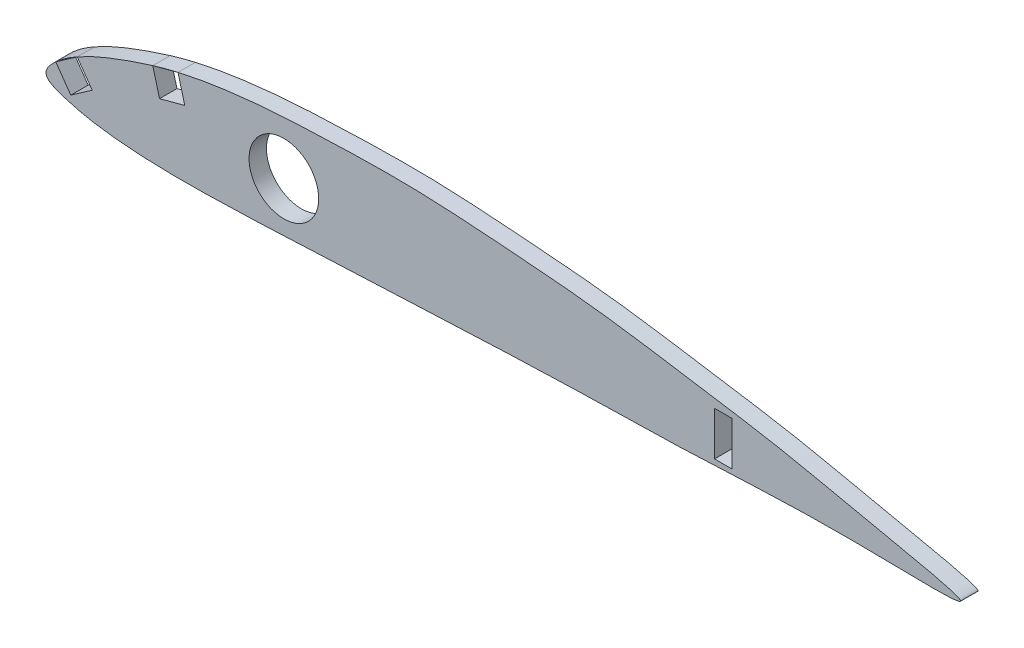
ISO-10303-21;
HEADER;
FILE_DESCRIPTION(('STEP AP214'),'2;1');
FILE_NAME('part.step','',(''),(''),'','','');
FILE_SCHEMA(('AUTOMOTIVE_DESIGN { 1 0 10303 214 1 1 1 1 }'));
ENDSEC;
DATA;
#1=APPLICATION_CONTEXT('core data for automotive mechanical design processes');
#2=APPLICATION_PROTOCOL_DEFINITION('international standard','automotive_design',2000,#1);
#3=PRODUCT_CONTEXT('',#1,'mechanical');
#4=PRODUCT('Part','Part','',(#3));
#5=PRODUCT_RELATED_PRODUCT_CATEGORY('part','',(#4));
#6=PRODUCT_DEFINITION_FORMATION('','',#4);
#7=PRODUCT_DEFINITION_CONTEXT('part definition',#1,'design');
#8=PRODUCT_DEFINITION('design','',#6,#7);
#9=PRODUCT_DEFINITION_SHAPE('','',#8);
#10=(LENGTH_UNIT() NAMED_UNIT(*) SI_UNIT(.MILLI.,.METRE.));
#11=(NAMED_UNIT(*) PLANE_ANGLE_UNIT() SI_UNIT($,.RADIAN.));
#12=(NAMED_UNIT(*) SI_UNIT($,.STERADIAN.) SOLID_ANGLE_UNIT());
#13=UNCERTAINTY_MEASURE_WITH_UNIT(LENGTH_MEASURE(1.E-05),#10,'distance_accuracy_value','');
#14=(GEOMETRIC_REPRESENTATION_CONTEXT(3) GLOBAL_UNCERTAINTY_ASSIGNED_CONTEXT((#13)) GLOBAL_UNIT_ASSIGNED_CONTEXT((#10,
#11,#12)) REPRESENTATION_CONTEXT('',''));
#15=CARTESIAN_POINT('',(0.,0.,0.));
#16=DIRECTION('',(0.,0.,1.));
#17=DIRECTION('',(1.,0.,0.));
#18=AXIS2_PLACEMENT_3D('',#15,#16,#17);
#19=CARTESIAN_POINT('',(0.,0.,0.));
#20=DIRECTION('',(0.,0.,-1.));
#21=DIRECTION('',(-1.,0.,0.));
#22=AXIS2_PLACEMENT_3D('',#19,#20,#21);
#23=PLANE('',#22);
#24=DIRECTION('',(0.,-1.,0.));
#25=VECTOR('',#24,1.);
#26=CARTESIAN_POINT('',(125.047,0.,0.));
#27=LINE('',#26,#25);
#28=CARTESIAN_POINT('',(125.047,8.,0.));
#29=VERTEX_POINT('',#28);
#30=CARTESIAN_POINT('',(125.047,0.,0.));
#31=VERTEX_POINT('',#30);
#32=EDGE_CURVE('E196',#29,#31,#27,.T.);
#33=ORIENTED_EDGE('',*,*,#32,.F.);
#34=DIRECTION('',(1.,0.,0.));
#35=VECTOR('',#34,1.);
#36=CARTESIAN_POINT('',(0.,8.,0.));
#37=LINE('',#36,#35);
#38=CARTESIAN_POINT('',(121.872,8.,0.));
#39=VERTEX_POINT('',#38);
#40=EDGE_CURVE('E144',#39,#29,#37,.T.);
#41=ORIENTED_EDGE('',*,*,#40,.F.);
#42=DIRECTION('',(0.,1.,0.));
#43=VECTOR('',#42,1.);
#44=CARTESIAN_POINT('',(121.872,0.,0.));
#45=LINE('',#44,#43);
#46=CARTESIAN_POINT('',(121.872,0.,0.));
#47=VERTEX_POINT('',#46);
#48=EDGE_CURVE('E132',#47,#39,#45,.T.);
#49=ORIENTED_EDGE('',*,*,#48,.F.);
#50=DIRECTION('',(-1.,0.,0.));
#51=VECTOR('',#50,1.);
#52=CARTESIAN_POINT('',(0.,1.4818536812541E-12,0.));
#53=LINE('',#52,#51);
#54=EDGE_CURVE('E152',#31,#47,#53,.T.);
#55=ORIENTED_EDGE('',*,*,#54,.F.);
#56=EDGE_LOOP('',(#33,#41,#49,#55));
#57=FACE_BOUND('',#56,.T.);
#58=DIRECTION('',(0.573576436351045,-0.819152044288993,0.));
#59=VECTOR('',#58,1.);
#60=CARTESIAN_POINT('',(6.34720029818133,4.44435749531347,0.));
#61=LINE('',#60,#59);
#62=CARTESIAN_POINT('',(5.68764872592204,5.38629475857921,0.));
#63=VERTEX_POINT('',#62);
#64=CARTESIAN_POINT('',(8.41930650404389,1.48508314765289,0.));
#65=VERTEX_POINT('',#64);
#66=EDGE_CURVE('E201',#63,#65,#61,.T.);
#67=ORIENTED_EDGE('',*,*,#66,.F.);
#68=CARTESIAN_POINT('',(0.,0.,0.));
#69=CARTESIAN_POINT('',(-0.0459347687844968,0.892029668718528,0.));
#70=CARTESIAN_POINT('',(1.90191177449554,2.89446911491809,0.));
#71=CARTESIAN_POINT('',(4.6684552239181,4.87588891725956,0.));
#72=CARTESIAN_POINT('',(8.2541015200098,6.80672662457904,0.));
#73=CARTESIAN_POINT('',(15.1207457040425,9.59988217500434,0.));
#74=CARTESIAN_POINT('',(23.4503914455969,12.2574932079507,0.));
#75=CARTESIAN_POINT('',(33.3103354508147,13.8342724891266,0.));
#76=CARTESIAN_POINT('',(41.6672100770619,14.6682605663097,0.));
#77=CARTESIAN_POINT('',(52.7910280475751,15.1344604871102,0.));
#78=CARTESIAN_POINT('',(66.7097954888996,15.5292364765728,0.));
#79=CARTESIAN_POINT('',(83.368588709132,14.3600514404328,0.));
#80=CARTESIAN_POINT('',(100.147657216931,13.0526280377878,0.));
#81=CARTESIAN_POINT('',(116.545994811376,10.4257396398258,0.));
#82=CARTESIAN_POINT('',(134.136976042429,7.73650957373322,0.));
#83=CARTESIAN_POINT('',(147.56176668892,4.57825905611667,0.));
#84=CARTESIAN_POINT('',(176.13881574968,-1.08233623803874,0.));
#85=CARTESIAN_POINT('',(139.163038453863,0.220038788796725,0.));
#86=CARTESIAN_POINT('',(123.083147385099,-1.25152694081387,0.));
#87=CARTESIAN_POINT('',(88.3709977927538,-1.79872524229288,0.));
#88=CARTESIAN_POINT('',(61.2366274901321,-3.27724658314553,0.));
#89=CARTESIAN_POINT('',(33.2993817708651,-4.49500477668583,0.));
#90=CARTESIAN_POINT('',(19.5697181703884,-4.72013261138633,0.));
#91=CARTESIAN_POINT('',(9.46401932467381,-3.74136507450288,0.));
#92=CARTESIAN_POINT('',(4.31935957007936,-2.56504228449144,0.));
#93=CARTESIAN_POINT('',(0.063034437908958,-1.22409647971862,0.));
#94=CARTESIAN_POINT('',(0.,0.,0.));
#95=B_SPLINE_CURVE_WITH_KNOTS('',3,(#68,#69,#70,#71,#72,#73,#74,#75,#76,#77,#78,#79,#80,#81,#82,
#83,#84,#85,#86,#87,#88,#89,#90,#91,#92,#93,#94),.UNSPECIFIED.,.T.,.F.,(4,1,1,1,1,1,1,1,1,1,1,1,
1,1,1,1,1,1,1,1,1,1,1,1,4),(0.,0.0105604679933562,0.0182111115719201,0.0322098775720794,
0.0455249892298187,0.0840694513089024,0.10897429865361,0.133649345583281,0.158232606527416,
0.207343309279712,0.25652270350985,0.30582635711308,0.355445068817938,0.40521420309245,
0.4553904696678,0.506006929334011,0.555121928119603,0.653369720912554,0.702490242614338,
0.849938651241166,0.899083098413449,0.948194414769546,0.972905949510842,0.985508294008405,1.),.UNSPECIFIED.);
#96=CARTESIAN_POINT('',(19.465770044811,10.8900291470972,0.));
#97=VERTEX_POINT('',#96);
#98=EDGE_CURVE('E171',#63,#97,#95,.T.);
#99=ORIENTED_EDGE('',*,*,#98,.T.);
#100=DIRECTION('',(-0.258819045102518,0.965925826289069,0.));
#101=VECTOR('',#100,1.);
#102=CARTESIAN_POINT('',(20.884317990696,5.59593614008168,0.));
#103=LINE('',#102,#101);
#104=CARTESIAN_POINT('',(20.6983957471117,6.28980739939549,0.));
#105=VERTEX_POINT('',#104);
#106=EDGE_CURVE('E210',#105,#97,#103,.T.);
#107=ORIENTED_EDGE('',*,*,#106,.F.);
#108=DIRECTION('',(-0.965925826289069,-0.258819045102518,0.));
#109=VECTOR('',#108,1.);
#110=CARTESIAN_POINT('',(-0.185922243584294,0.693871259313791,0.));
#111=LINE('',#110,#109);
#112=CARTESIAN_POINT('',(25.2986174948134,7.52243310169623,0.));
#113=VERTEX_POINT('',#112);
#114=EDGE_CURVE('E220',#113,#105,#111,.T.);
#115=ORIENTED_EDGE('',*,*,#114,.F.);
#116=DIRECTION('',(0.258819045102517,-0.965925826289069,0.));
#117=VECTOR('',#116,1.);
#118=CARTESIAN_POINT('',(25.4845397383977,6.82856184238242,0.));
#119=LINE('',#118,#117);
#120=CARTESIAN_POINT('',(24.0659917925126,12.1226548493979,0.));
#121=VERTEX_POINT('',#120);
#122=EDGE_CURVE('E230',#121,#113,#119,.T.);
#123=ORIENTED_EDGE('',*,*,#122,.F.);
#124=CARTESIAN_POINT('',(1.78643711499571,2.65463698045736,0.));
#125=VERTEX_POINT('',#124);
#126=EDGE_CURVE('E164',#121,#125,#95,.T.);
#127=ORIENTED_EDGE('',*,*,#126,.T.);
#128=DIRECTION('',(-0.573576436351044,0.819152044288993,0.));
#129=VECTOR('',#128,1.);
#130=CARTESIAN_POINT('',(2.445988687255,1.71269971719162,0.));
#131=LINE('',#130,#129);
#132=CARTESIAN_POINT('',(4.51809489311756,-1.24657463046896,0.));
#133=VERTEX_POINT('',#132);
#134=EDGE_CURVE('E158',#133,#125,#131,.T.);
#135=ORIENTED_EDGE('',*,*,#134,.F.);
#136=DIRECTION('',(-0.819152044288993,-0.573576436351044,0.));
#137=VECTOR('',#136,1.);
#138=CARTESIAN_POINT('',(2.07210620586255,-2.95927434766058,0.));
#139=LINE('',#138,#137);
#140=EDGE_CURVE('E162',#65,#133,#139,.T.);
#141=ORIENTED_EDGE('',*,*,#140,.F.);
#142=EDGE_LOOP('',(#67,#99,#107,#115,#123,#127,#135,#141));
#143=FACE_BOUND('',#142,.T.);
#144=CARTESIAN_POINT('',(43.365,4.99999999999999,0.));
#145=DIRECTION('',(0.,0.,-1.));
#146=DIRECTION('',(-1.,0.,0.));
#147=AXIS2_PLACEMENT_3D('',#144,#145,#146);
#148=CIRCLE('',#147,6.35);
#149=CARTESIAN_POINT('',(37.015,4.99999999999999,0.));
#150=VERTEX_POINT('',#149);
#151=EDGE_CURVE('E204',#150,#150,#148,.T.);
#152=ORIENTED_EDGE('',*,*,#151,.F.);
#153=EDGE_LOOP('',(#152));
#154=FACE_BOUND('',#153,.T.);
#155=ADVANCED_FACE('F45',(#57,#143,#154),#23,.T.);
#156=CARTESIAN_POINT('',(0.,0.,3.175));
#157=DIRECTION('',(0.,0.,-1.));
#158=DIRECTION('',(-1.,0.,0.));
#159=AXIS2_PLACEMENT_3D('',#156,#157,#158);
#160=PLANE('',#159);
#161=DIRECTION('',(-1.,0.,0.));
#162=VECTOR('',#161,1.);
#163=CARTESIAN_POINT('',(125.047,8.,3.175));
#164=LINE('',#163,#162);
#165=CARTESIAN_POINT('',(125.047,8.,3.175));
#166=VERTEX_POINT('',#165);
#167=CARTESIAN_POINT('',(121.872,8.,3.175));
#168=VERTEX_POINT('',#167);
#169=EDGE_CURVE('E13',#166,#168,#164,.T.);
#170=ORIENTED_EDGE('',*,*,#169,.F.);
#171=DIRECTION('',(0.,1.,0.));
#172=VECTOR('',#171,1.);
#173=CARTESIAN_POINT('',(125.047,0.,3.175));
#174=LINE('',#173,#172);
#175=CARTESIAN_POINT('',(125.047,0.,3.175));
#176=VERTEX_POINT('',#175);
#177=EDGE_CURVE('E150',#176,#166,#174,.T.);
#178=ORIENTED_EDGE('',*,*,#177,.F.);
#179=DIRECTION('',(1.,0.,0.));
#180=VECTOR('',#179,1.);
#181=CARTESIAN_POINT('',(125.047,0.,3.175));
#182=LINE('',#181,#180);
#183=CARTESIAN_POINT('',(121.872,0.,3.175));
#184=VERTEX_POINT('',#183);
#185=EDGE_CURVE('E143',#184,#176,#182,.T.);
#186=ORIENTED_EDGE('',*,*,#185,.F.);
#187=DIRECTION('',(0.,-1.,0.));
#188=VECTOR('',#187,1.);
#189=CARTESIAN_POINT('',(121.872,0.,3.175));
#190=LINE('',#189,#188);
#191=EDGE_CURVE('E129',#168,#184,#190,.T.);
#192=ORIENTED_EDGE('',*,*,#191,.F.);
#193=EDGE_LOOP('',(#170,#178,#186,#192));
#194=FACE_BOUND('',#193,.T.);
#195=CARTESIAN_POINT('',(43.365,4.99999999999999,3.175));
#196=DIRECTION('',(0.,0.,1.));
#197=DIRECTION('',(1.,0.,0.));
#198=AXIS2_PLACEMENT_3D('',#195,#196,#197);
#199=CIRCLE('',#198,6.35);
#200=CARTESIAN_POINT('',(49.715,4.99999999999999,3.175));
#201=VERTEX_POINT('',#200);
#202=EDGE_CURVE('E206',#201,#201,#199,.T.);
#203=ORIENTED_EDGE('',*,*,#202,.F.);
#204=EDGE_LOOP('',(#203));
#205=FACE_BOUND('',#204,.T.);
#206=CARTESIAN_POINT('',(0.,0.,3.175));
#207=CARTESIAN_POINT('',(-0.0459347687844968,0.892029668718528,3.175));
#208=CARTESIAN_POINT('',(1.90191177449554,2.89446911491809,3.175));
#209=CARTESIAN_POINT('',(4.6684552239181,4.87588891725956,3.175));
#210=CARTESIAN_POINT('',(8.2541015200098,6.80672662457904,3.175));
#211=CARTESIAN_POINT('',(15.1207457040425,9.59988217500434,3.175));
#212=CARTESIAN_POINT('',(23.4503914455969,12.2574932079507,3.175));
#213=CARTESIAN_POINT('',(33.3103354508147,13.8342724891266,3.175));
#214=CARTESIAN_POINT('',(41.6672100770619,14.6682605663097,3.175));
#215=CARTESIAN_POINT('',(52.7910280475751,15.1344604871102,3.175));
#216=CARTESIAN_POINT('',(66.7097954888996,15.5292364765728,3.175));
#217=CARTESIAN_POINT('',(83.368588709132,14.3600514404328,3.175));
#218=CARTESIAN_POINT('',(100.147657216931,13.0526280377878,3.175));
#219=CARTESIAN_POINT('',(116.545994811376,10.4257396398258,3.175));
#220=CARTESIAN_POINT('',(134.136976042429,7.73650957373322,3.175));
#221=CARTESIAN_POINT('',(147.56176668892,4.57825905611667,3.175));
#222=CARTESIAN_POINT('',(176.13881574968,-1.08233623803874,3.175));
#223=CARTESIAN_POINT('',(139.163038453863,0.220038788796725,3.175));
#224=CARTESIAN_POINT('',(123.083147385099,-1.25152694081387,3.175));
#225=CARTESIAN_POINT('',(88.3709977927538,-1.79872524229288,3.175));
#226=CARTESIAN_POINT('',(61.2366274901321,-3.27724658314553,3.175));
#227=CARTESIAN_POINT('',(33.2993817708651,-4.49500477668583,3.175));
#228=CARTESIAN_POINT('',(19.5697181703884,-4.72013261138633,3.175));
#229=CARTESIAN_POINT('',(9.46401932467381,-3.74136507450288,3.175));
#230=CARTESIAN_POINT('',(4.31935957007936,-2.56504228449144,3.175));
#231=CARTESIAN_POINT('',(0.063034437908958,-1.22409647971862,3.175));
#232=CARTESIAN_POINT('',(0.,0.,3.175));
#233=B_SPLINE_CURVE_WITH_KNOTS('',3,(#206,#207,#208,#209,#210,#211,#212,#213,#214,#215,#216,
#217,#218,#219,#220,#221,#222,#223,#224,#225,#226,#227,#228,#229,#230,#231,#232),.UNSPECIFIED.,
.T.,.F.,(4,1,1,1,1,1,1,1,1,1,1,1,1,1,1,1,1,1,1,1,1,1,1,1,4),(0.,0.0105604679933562,
0.0182111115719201,0.0322098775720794,0.0455249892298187,0.0840694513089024,0.10897429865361,
0.133649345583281,0.158232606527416,0.207343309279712,0.25652270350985,0.30582635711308,
0.355445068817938,0.40521420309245,0.4553904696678,0.506006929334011,0.555121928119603,
0.653369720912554,0.702490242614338,0.849938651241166,0.899083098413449,0.948194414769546,
0.972905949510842,0.985508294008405,1.),.UNSPECIFIED.);
#234=CARTESIAN_POINT('',(5.68764872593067,5.3862947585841,3.175));
#235=VERTEX_POINT('',#234);
#236=CARTESIAN_POINT('',(19.465770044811,10.8900291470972,3.175));
#237=VERTEX_POINT('',#236);
#238=EDGE_CURVE('E207',#235,#237,#233,.T.);
#239=ORIENTED_EDGE('',*,*,#238,.F.);
#240=DIRECTION('',(-0.573576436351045,0.819152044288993,0.));
#241=VECTOR('',#240,1.);
#242=CARTESIAN_POINT('',(5.68764872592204,5.38629475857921,3.175));
#243=LINE('',#242,#241);
#244=CARTESIAN_POINT('',(8.41930650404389,1.48508314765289,3.175));
#245=VERTEX_POINT('',#244);
#246=EDGE_CURVE('E163',#245,#235,#243,.T.);
#247=ORIENTED_EDGE('',*,*,#246,.F.);
#248=DIRECTION('',(0.819152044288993,0.573576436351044,0.));
#249=VECTOR('',#248,1.);
#250=CARTESIAN_POINT('',(8.41930650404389,1.48508314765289,3.175));
#251=LINE('',#250,#249);
#252=CARTESIAN_POINT('',(4.51809489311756,-1.24657463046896,3.175));
#253=VERTEX_POINT('',#252);
#254=EDGE_CURVE('E228',#253,#245,#251,.T.);
#255=ORIENTED_EDGE('',*,*,#254,.F.);
#256=DIRECTION('',(0.573576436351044,-0.819152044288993,0.));
#257=VECTOR('',#256,1.);
#258=CARTESIAN_POINT('',(1.78643711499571,2.65463698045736,3.175));
#259=LINE('',#258,#257);
#260=CARTESIAN_POINT('',(1.78643711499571,2.65463698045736,3.175));
#261=VERTEX_POINT('',#260);
#262=EDGE_CURVE('E157',#261,#253,#259,.T.);
#263=ORIENTED_EDGE('',*,*,#262,.F.);
#264=CARTESIAN_POINT('',(24.0659923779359,12.1226549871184,3.175));
#265=VERTEX_POINT('',#264);
#266=EDGE_CURVE('E213',#265,#261,#233,.T.);
#267=ORIENTED_EDGE('',*,*,#266,.F.);
#268=DIRECTION('',(-0.258819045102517,0.965925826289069,0.));
#269=VECTOR('',#268,1.);
#270=CARTESIAN_POINT('',(24.0659917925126,12.1226548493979,3.175));
#271=LINE('',#270,#269);
#272=CARTESIAN_POINT('',(25.2986174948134,7.52243310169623,3.175));
#273=VERTEX_POINT('',#272);
#274=EDGE_CURVE('E223',#273,#265,#271,.T.);
#275=ORIENTED_EDGE('',*,*,#274,.F.);
#276=DIRECTION('',(0.965925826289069,0.258819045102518,0.));
#277=VECTOR('',#276,1.);
#278=CARTESIAN_POINT('',(20.6983957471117,6.28980739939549,3.175));
#279=LINE('',#278,#277);
#280=CARTESIAN_POINT('',(20.6983957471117,6.28980739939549,3.175));
#281=VERTEX_POINT('',#280);
#282=EDGE_CURVE('E226',#281,#273,#279,.T.);
#283=ORIENTED_EDGE('',*,*,#282,.F.);
#284=DIRECTION('',(0.258819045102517,-0.965925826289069,0.));
#285=VECTOR('',#284,1.);
#286=CARTESIAN_POINT('',(19.465770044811,10.8900291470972,3.175));
#287=LINE('',#286,#285);
#288=EDGE_CURVE('E233',#237,#281,#287,.T.);
#289=ORIENTED_EDGE('',*,*,#288,.F.);
#290=EDGE_LOOP('',(#239,#247,#255,#263,#267,#275,#283,#289));
#291=FACE_BOUND('',#290,.T.);
#292=ADVANCED_FACE('F141',(#194,#205,#291),#160,.F.);
#293=DIRECTION('',(0.,0.,1.));
#294=VECTOR('',#293,1.);
#295=SURFACE_OF_LINEAR_EXTRUSION('',#95,#294);
#296=DIRECTION('',(0.,0.,1.));
#297=VECTOR('',#296,1.);
#298=CARTESIAN_POINT('',(1.78643711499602,2.65463698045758,0.));
#299=LINE('',#298,#297);
#300=EDGE_CURVE('E154',#125,#261,#299,.T.);
#301=ORIENTED_EDGE('',*,*,#300,.F.);
#302=ORIENTED_EDGE('',*,*,#126,.F.);
#303=DIRECTION('',(0.,0.,1.));
#304=VECTOR('',#303,1.);
#305=CARTESIAN_POINT('',(24.0659917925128,12.122654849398,0.));
#306=LINE('',#305,#304);
#307=EDGE_CURVE('E170',#121,#265,#306,.T.);
#308=ORIENTED_EDGE('',*,*,#307,.T.);
#309=ORIENTED_EDGE('',*,*,#266,.T.);
#310=EDGE_LOOP('',(#301,#302,#308,#309));
#311=FACE_BOUND('',#310,.T.);
#312=ADVANCED_FACE('F180',(#311),#295,.F.);
#313=DIRECTION('',(0.,0.,1.));
#314=VECTOR('',#313,1.);
#315=CARTESIAN_POINT('',(5.68764872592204,5.38629475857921,0.));
#316=LINE('',#315,#314);
#317=EDGE_CURVE('E159',#235,#63,#316,.F.);
#318=ORIENTED_EDGE('',*,*,#317,.F.);
#319=ORIENTED_EDGE('',*,*,#238,.T.);
#320=DIRECTION('',(0.,0.,1.));
#321=VECTOR('',#320,1.);
#322=CARTESIAN_POINT('',(19.4657700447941,10.8900291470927,0.));
#323=LINE('',#322,#321);
#324=EDGE_CURVE('E48',#97,#237,#323,.T.);
#325=ORIENTED_EDGE('',*,*,#324,.F.);
#326=ORIENTED_EDGE('',*,*,#98,.F.);
#327=EDGE_LOOP('',(#318,#319,#325,#326));
#328=FACE_BOUND('',#327,.T.);
#329=ADVANCED_FACE('F176',(#328),#295,.F.);
#330=CARTESIAN_POINT('',(43.365,4.99999999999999,-6.825));
#331=DIRECTION('',(0.,0.,1.));
#332=DIRECTION('',(1.,0.,0.));
#333=AXIS2_PLACEMENT_3D('',#330,#331,#332);
#334=CYLINDRICAL_SURFACE('',#333,6.35);
#335=ORIENTED_EDGE('',*,*,#151,.T.);
#336=EDGE_LOOP('',(#335));
#337=FACE_BOUND('',#336,.T.);
#338=ORIENTED_EDGE('',*,*,#202,.T.);
#339=EDGE_LOOP('',(#338));
#340=FACE_BOUND('',#339,.T.);
#341=ADVANCED_FACE('F179',(#337,#340),#334,.F.);
#342=CARTESIAN_POINT('',(19.465770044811,10.8900291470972,-6.825));
#343=DIRECTION('',(-0.965925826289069,-0.258819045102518,0.));
#344=DIRECTION('',(0.258819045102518,-0.965925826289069,0.));
#345=AXIS2_PLACEMENT_3D('',#342,#343,#344);
#346=PLANE('',#345);
#347=ORIENTED_EDGE('',*,*,#106,.T.);
#348=ORIENTED_EDGE('',*,*,#324,.T.);
#349=ORIENTED_EDGE('',*,*,#288,.T.);
#350=DIRECTION('',(0.,0.,1.));
#351=VECTOR('',#350,1.);
#352=CARTESIAN_POINT('',(20.6983957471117,6.28980739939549,-6.825));
#353=LINE('',#352,#351);
#354=EDGE_CURVE('E222',#105,#281,#353,.T.);
#355=ORIENTED_EDGE('',*,*,#354,.F.);
#356=EDGE_LOOP('',(#347,#348,#349,#355));
#357=FACE_BOUND('',#356,.T.);
#358=ADVANCED_FACE('F326',(#357),#346,.F.);
#359=CARTESIAN_POINT('',(24.0659917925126,12.1226548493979,-6.825));
#360=DIRECTION('',(0.965925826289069,0.258819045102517,0.));
#361=DIRECTION('',(-0.258819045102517,0.965925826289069,0.));
#362=AXIS2_PLACEMENT_3D('',#359,#360,#361);
#363=PLANE('',#362);
#364=ORIENTED_EDGE('',*,*,#122,.T.);
#365=DIRECTION('',(0.,0.,1.));
#366=VECTOR('',#365,1.);
#367=CARTESIAN_POINT('',(25.2986174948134,7.52243310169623,-6.825));
#368=LINE('',#367,#366);
#369=EDGE_CURVE('E232',#113,#273,#368,.T.);
#370=ORIENTED_EDGE('',*,*,#369,.T.);
#371=ORIENTED_EDGE('',*,*,#274,.T.);
#372=ORIENTED_EDGE('',*,*,#307,.F.);
#373=EDGE_LOOP('',(#364,#370,#371,#372));
#374=FACE_BOUND('',#373,.T.);
#375=ADVANCED_FACE('F316',(#374),#363,.F.);
#376=CARTESIAN_POINT('',(20.6983957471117,6.28980739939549,-6.825));
#377=DIRECTION('',(0.258819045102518,-0.965925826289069,0.));
#378=DIRECTION('',(0.965925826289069,0.258819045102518,0.));
#379=AXIS2_PLACEMENT_3D('',#376,#377,#378);
#380=PLANE('',#379);
#381=ORIENTED_EDGE('',*,*,#114,.T.);
#382=ORIENTED_EDGE('',*,*,#354,.T.);
#383=ORIENTED_EDGE('',*,*,#282,.T.);
#384=ORIENTED_EDGE('',*,*,#369,.F.);
#385=EDGE_LOOP('',(#381,#382,#383,#384));
#386=FACE_BOUND('',#385,.T.);
#387=ADVANCED_FACE('F306',(#386),#380,.F.);
#388=CARTESIAN_POINT('',(5.68764872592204,5.38629475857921,-6.825));
#389=DIRECTION('',(0.819152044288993,0.573576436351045,0.));
#390=DIRECTION('',(-0.573576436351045,0.819152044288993,0.));
#391=AXIS2_PLACEMENT_3D('',#388,#389,#390);
#392=PLANE('',#391);
#393=ORIENTED_EDGE('',*,*,#66,.T.);
#394=DIRECTION('',(0.,0.,1.));
#395=VECTOR('',#394,1.);
#396=CARTESIAN_POINT('',(8.41930650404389,1.48508314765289,-6.825));
#397=LINE('',#396,#395);
#398=EDGE_CURVE('E225',#65,#245,#397,.T.);
#399=ORIENTED_EDGE('',*,*,#398,.T.);
#400=ORIENTED_EDGE('',*,*,#246,.T.);
#401=ORIENTED_EDGE('',*,*,#317,.T.);
#402=EDGE_LOOP('',(#393,#399,#400,#401));
#403=FACE_BOUND('',#402,.T.);
#404=ADVANCED_FACE('F297',(#403),#392,.F.);
#405=CARTESIAN_POINT('',(8.41930650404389,1.48508314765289,-6.825));
#406=DIRECTION('',(0.573576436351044,-0.819152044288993,0.));
#407=DIRECTION('',(0.819152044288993,0.573576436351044,0.));
#408=AXIS2_PLACEMENT_3D('',#405,#406,#407);
#409=PLANE('',#408);
#410=ORIENTED_EDGE('',*,*,#140,.T.);
#411=DIRECTION('',(0.,0.,1.));
#412=VECTOR('',#411,1.);
#413=CARTESIAN_POINT('',(4.51809489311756,-1.24657463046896,-6.825));
#414=LINE('',#413,#412);
#415=EDGE_CURVE('E219',#133,#253,#414,.T.);
#416=ORIENTED_EDGE('',*,*,#415,.T.);
#417=ORIENTED_EDGE('',*,*,#254,.T.);
#418=ORIENTED_EDGE('',*,*,#398,.F.);
#419=EDGE_LOOP('',(#410,#416,#417,#418));
#420=FACE_BOUND('',#419,.T.);
#421=ADVANCED_FACE('F262',(#420),#409,.F.);
#422=CARTESIAN_POINT('',(1.78643711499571,2.65463698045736,-6.825));
#423=DIRECTION('',(-0.819152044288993,-0.573576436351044,0.));
#424=DIRECTION('',(0.573576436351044,-0.819152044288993,0.));
#425=AXIS2_PLACEMENT_3D('',#422,#423,#424);
#426=PLANE('',#425);
#427=ORIENTED_EDGE('',*,*,#134,.T.);
#428=ORIENTED_EDGE('',*,*,#300,.T.);
#429=ORIENTED_EDGE('',*,*,#262,.T.);
#430=ORIENTED_EDGE('',*,*,#415,.F.);
#431=EDGE_LOOP('',(#427,#428,#429,#430));
#432=FACE_BOUND('',#431,.T.);
#433=ADVANCED_FACE('F257',(#432),#426,.F.);
#434=CARTESIAN_POINT('',(125.047,0.,-6.825));
#435=DIRECTION('',(1.,0.,0.));
#436=DIRECTION('',(0.,0.,-1.));
#437=AXIS2_PLACEMENT_3D('',#434,#435,#436);
#438=PLANE('',#437);
#439=ORIENTED_EDGE('',*,*,#32,.T.);
#440=DIRECTION('',(0.,0.,1.));
#441=VECTOR('',#440,1.);
#442=CARTESIAN_POINT('',(125.047,0.,-6.825));
#443=LINE('',#442,#441);
#444=EDGE_CURVE('E153',#31,#176,#443,.T.);
#445=ORIENTED_EDGE('',*,*,#444,.T.);
#446=ORIENTED_EDGE('',*,*,#177,.T.);
#447=DIRECTION('',(0.,0.,1.));
#448=VECTOR('',#447,1.);
#449=CARTESIAN_POINT('',(125.047,8.,-6.825));
#450=LINE('',#449,#448);
#451=EDGE_CURVE('E54',#29,#166,#450,.T.);
#452=ORIENTED_EDGE('',*,*,#451,.F.);
#453=EDGE_LOOP('',(#439,#445,#446,#452));
#454=FACE_BOUND('',#453,.T.);
#455=ADVANCED_FACE('F251',(#454),#438,.F.);
#456=CARTESIAN_POINT('',(125.047,0.,-6.825));
#457=DIRECTION('',(0.,-1.,0.));
#458=DIRECTION('',(1.,0.,0.));
#459=AXIS2_PLACEMENT_3D('',#456,#457,#458);
#460=PLANE('',#459);
#461=ORIENTED_EDGE('',*,*,#54,.T.);
#462=DIRECTION('',(0.,0.,1.));
#463=VECTOR('',#462,1.);
#464=CARTESIAN_POINT('',(121.872,0.,-6.825));
#465=LINE('',#464,#463);
#466=EDGE_CURVE('E124',#47,#184,#465,.T.);
#467=ORIENTED_EDGE('',*,*,#466,.T.);
#468=ORIENTED_EDGE('',*,*,#185,.T.);
#469=ORIENTED_EDGE('',*,*,#444,.F.);
#470=EDGE_LOOP('',(#461,#467,#468,#469));
#471=FACE_BOUND('',#470,.T.);
#472=ADVANCED_FACE('F182',(#471),#460,.F.);
#473=CARTESIAN_POINT('',(121.872,0.,-6.825));
#474=DIRECTION('',(-1.,0.,0.));
#475=DIRECTION('',(0.,0.,1.));
#476=AXIS2_PLACEMENT_3D('',#473,#474,#475);
#477=PLANE('',#476);
#478=ORIENTED_EDGE('',*,*,#48,.T.);
#479=DIRECTION('',(0.,0.,1.));
#480=VECTOR('',#479,1.);
#481=CARTESIAN_POINT('',(121.872,8.,-6.825));
#482=LINE('',#481,#480);
#483=EDGE_CURVE('E62',#39,#168,#482,.T.);
#484=ORIENTED_EDGE('',*,*,#483,.T.);
#485=ORIENTED_EDGE('',*,*,#191,.T.);
#486=ORIENTED_EDGE('',*,*,#466,.F.);
#487=EDGE_LOOP('',(#478,#484,#485,#486));
#488=FACE_BOUND('',#487,.T.);
#489=ADVANCED_FACE('F127',(#488),#477,.F.);
#490=CARTESIAN_POINT('',(125.047,8.,-6.825));
#491=DIRECTION('',(0.,1.,0.));
#492=DIRECTION('',(0.,0.,1.));
#493=AXIS2_PLACEMENT_3D('',#490,#491,#492);
#494=PLANE('',#493);
#495=ORIENTED_EDGE('',*,*,#40,.T.);
#496=ORIENTED_EDGE('',*,*,#451,.T.);
#497=ORIENTED_EDGE('',*,*,#169,.T.);
#498=ORIENTED_EDGE('',*,*,#483,.F.);
#499=EDGE_LOOP('',(#495,#496,#497,#498));
#500=FACE_BOUND('',#499,.T.);
#501=ADVANCED_FACE('F137',(#500),#494,.F.);
#502=CLOSED_SHELL('',(#155,#292,#312,#329,#341,#358,#375,#387,#404,#421,#433,#455,#472,#489,#501));
#503=MANIFOLD_SOLID_BREP('B2',#502);
#504=CARTESIAN_POINT('',(0.,0.,0.));
#505=CARTESIAN_POINT('',(-0.0459347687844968,0.892029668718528,0.));
#506=CARTESIAN_POINT('',(1.90191177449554,2.89446911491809,0.));
#507=CARTESIAN_POINT('',(4.6684552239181,4.87588891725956,0.));
#508=CARTESIAN_POINT('',(8.2541015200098,6.80672662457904,0.));
#509=CARTESIAN_POINT('',(15.1207457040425,9.59988217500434,0.));
#510=CARTESIAN_POINT('',(23.4503914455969,12.2574932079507,0.));
#511=CARTESIAN_POINT('',(33.3103354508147,13.8342724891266,0.));
#512=CARTESIAN_POINT('',(41.6672100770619,14.6682605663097,0.));
#513=CARTESIAN_POINT('',(52.7910280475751,15.1344604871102,0.));
#514=CARTESIAN_POINT('',(66.7097954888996,15.5292364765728,0.));
#515=CARTESIAN_POINT('',(83.368588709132,14.3600514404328,0.));
#516=CARTESIAN_POINT('',(100.147657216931,13.0526280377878,0.));
#517=CARTESIAN_POINT('',(116.545994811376,10.4257396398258,0.));
#518=CARTESIAN_POINT('',(134.136976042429,7.73650957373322,0.));
#519=CARTESIAN_POINT('',(147.56176668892,4.57825905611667,0.));
#520=CARTESIAN_POINT('',(176.13881574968,-1.08233623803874,0.));
#521=CARTESIAN_POINT('',(139.163038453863,0.220038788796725,0.));
#522=CARTESIAN_POINT('',(123.083147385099,-1.25152694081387,0.));
#523=CARTESIAN_POINT('',(88.3709977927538,-1.79872524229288,0.));
#524=CARTESIAN_POINT('',(61.2366274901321,-3.27724658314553,0.));
#525=CARTESIAN_POINT('',(33.2993817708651,-4.49500477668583,0.));
#526=CARTESIAN_POINT('',(19.5697181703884,-4.72013261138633,0.));
#527=CARTESIAN_POINT('',(9.46401932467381,-3.74136507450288,0.));
#528=CARTESIAN_POINT('',(4.31935957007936,-2.56504228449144,0.));
#529=CARTESIAN_POINT('',(0.063034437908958,-1.22409647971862,0.));
#530=CARTESIAN_POINT('',(0.,0.,0.));
#531=B_SPLINE_CURVE_WITH_KNOTS('',3,(#504,#505,#506,#507,#508,#509,#510,#511,#512,#513,#514,
#515,#516,#517,#518,#519,#520,#521,#522,#523,#524,#525,#526,#527,#528,#529,#530),.UNSPECIFIED.,
.T.,.F.,(4,1,1,1,1,1,1,1,1,1,1,1,1,1,1,1,1,1,1,1,1,1,1,1,4),(0.,0.0105604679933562,
0.0182111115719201,0.0322098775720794,0.0455249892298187,0.0840694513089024,0.10897429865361,
0.133649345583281,0.158232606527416,0.207343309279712,0.25652270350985,0.30582635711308,
0.355445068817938,0.40521420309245,0.4553904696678,0.506006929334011,0.555121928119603,
0.653369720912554,0.702490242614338,0.849938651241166,0.899083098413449,0.948194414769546,
0.972905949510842,0.985508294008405,1.),.UNSPECIFIED.);
#532=DIRECTION('',(0.,0.,1.));
#533=VECTOR('',#532,1.);
#534=SURFACE_OF_LINEAR_EXTRUSION('',#531,#533);
#535=CARTESIAN_POINT('',(19.465770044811,10.8900291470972,0.));
#536=VERTEX_POINT('',#535);
#537=CARTESIAN_POINT('',(24.0659917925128,12.122654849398,0.));
#538=VERTEX_POINT('',#537);
#539=EDGE_CURVE('E449',#536,#538,#531,.T.);
#540=ORIENTED_EDGE('',*,*,#539,.F.);
#541=DIRECTION('',(0.,0.,1.));
#542=VECTOR('',#541,1.);
#543=CARTESIAN_POINT('',(19.4657700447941,10.8900291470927,0.));
#544=LINE('',#543,#542);
#545=CARTESIAN_POINT('',(19.465770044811,10.8900291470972,3.175));
#546=VERTEX_POINT('',#545);
#547=EDGE_CURVE('E436',#536,#546,#544,.T.);
#548=ORIENTED_EDGE('',*,*,#547,.T.);
#549=CARTESIAN_POINT('',(0.,0.,3.175));
#550=CARTESIAN_POINT('',(-0.0459347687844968,0.892029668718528,3.175));
#551=CARTESIAN_POINT('',(1.90191177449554,2.89446911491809,3.175));
#552=CARTESIAN_POINT('',(4.6684552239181,4.87588891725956,3.175));
#553=CARTESIAN_POINT('',(8.2541015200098,6.80672662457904,3.175));
#554=CARTESIAN_POINT('',(15.1207457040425,9.59988217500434,3.175));
#555=CARTESIAN_POINT('',(23.4503914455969,12.2574932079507,3.175));
#556=CARTESIAN_POINT('',(33.3103354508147,13.8342724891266,3.175));
#557=CARTESIAN_POINT('',(41.6672100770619,14.6682605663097,3.175));
#558=CARTESIAN_POINT('',(52.7910280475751,15.1344604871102,3.175));
#559=CARTESIAN_POINT('',(66.7097954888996,15.5292364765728,3.175));
#560=CARTESIAN_POINT('',(83.368588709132,14.3600514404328,3.175));
#561=CARTESIAN_POINT('',(100.147657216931,13.0526280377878,3.175));
#562=CARTESIAN_POINT('',(116.545994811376,10.4257396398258,3.175));
#563=CARTESIAN_POINT('',(134.136976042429,7.73650957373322,3.175));
#564=CARTESIAN_POINT('',(147.56176668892,4.57825905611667,3.175));
#565=CARTESIAN_POINT('',(176.13881574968,-1.08233623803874,3.175));
#566=CARTESIAN_POINT('',(139.163038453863,0.220038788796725,3.175));
#567=CARTESIAN_POINT('',(123.083147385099,-1.25152694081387,3.175));
#568=CARTESIAN_POINT('',(88.3709977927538,-1.79872524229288,3.175));
#569=CARTESIAN_POINT('',(61.2366274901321,-3.27724658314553,3.175));
#570=CARTESIAN_POINT('',(33.2993817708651,-4.49500477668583,3.175));
#571=CARTESIAN_POINT('',(19.5697181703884,-4.72013261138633,3.175));
#572=CARTESIAN_POINT('',(9.46401932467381,-3.74136507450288,3.175));
#573=CARTESIAN_POINT('',(4.31935957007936,-2.56504228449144,3.175));
#574=CARTESIAN_POINT('',(0.063034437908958,-1.22409647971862,3.175));
#575=CARTESIAN_POINT('',(0.,0.,3.175));
#576=B_SPLINE_CURVE_WITH_KNOTS('',3,(#549,#550,#551,#552,#553,#554,#555,#556,#557,#558,#559,
#560,#561,#562,#563,#564,#565,#566,#567,#568,#569,#570,#571,#572,#573,#574,#575),.UNSPECIFIED.,
.T.,.F.,(4,1,1,1,1,1,1,1,1,1,1,1,1,1,1,1,1,1,1,1,1,1,1,1,4),(0.,0.0105604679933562,
0.0182111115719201,0.0322098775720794,0.0455249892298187,0.0840694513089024,0.10897429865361,
0.133649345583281,0.158232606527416,0.207343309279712,0.25652270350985,0.30582635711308,
0.355445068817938,0.40521420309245,0.4553904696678,0.506006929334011,0.555121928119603,
0.653369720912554,0.702490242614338,0.849938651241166,0.899083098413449,0.948194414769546,
0.972905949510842,0.985508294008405,1.),.UNSPECIFIED.);
#577=CARTESIAN_POINT('',(24.0659917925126,12.1226548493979,3.175));
#578=VERTEX_POINT('',#577);
#579=EDGE_CURVE('E421',#546,#578,#576,.T.);
#580=ORIENTED_EDGE('',*,*,#579,.T.);
#581=DIRECTION('',(0.,0.,1.));
#582=VECTOR('',#581,1.);
#583=CARTESIAN_POINT('',(24.0659917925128,12.122654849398,0.));
#584=LINE('',#583,#582);
#585=EDGE_CURVE('E429',#538,#578,#584,.T.);
#586=ORIENTED_EDGE('',*,*,#585,.F.);
#587=EDGE_LOOP('',(#540,#548,#580,#586));
#588=FACE_BOUND('',#587,.T.);
#589=ADVANCED_FACE('F417',(#588),#534,.F.);
#590=CARTESIAN_POINT('',(0.,0.,3.175));
#591=DIRECTION('',(0.,0.,-1.));
#592=DIRECTION('',(-1.,0.,0.));
#593=AXIS2_PLACEMENT_3D('',#590,#591,#592);
#594=PLANE('',#593);
#595=ORIENTED_EDGE('',*,*,#579,.F.);
#596=DIRECTION('',(-0.965925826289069,-0.258819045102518,0.));
#597=VECTOR('',#596,1.);
#598=CARTESIAN_POINT('',(19.465770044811,10.8900291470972,3.175));
#599=LINE('',#598,#597);
#600=EDGE_CURVE('E43',#578,#546,#599,.T.);
#601=ORIENTED_EDGE('',*,*,#600,.F.);
#602=EDGE_LOOP('',(#595,#601));
#603=FACE_BOUND('',#602,.T.);
#604=ADVANCED_FACE('F464',(#603),#594,.F.);
#605=CARTESIAN_POINT('',(0.,0.,0.));
#606=DIRECTION('',(0.,0.,-1.));
#607=DIRECTION('',(-1.,0.,0.));
#608=AXIS2_PLACEMENT_3D('',#605,#606,#607);
#609=PLANE('',#608);
#610=DIRECTION('',(0.965925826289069,0.258819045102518,0.));
#611=VECTOR('',#610,1.);
#612=CARTESIAN_POINT('',(-1.41854794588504,5.29409300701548,0.));
#613=LINE('',#612,#611);
#614=EDGE_CURVE('E443',#536,#538,#613,.T.);
#615=ORIENTED_EDGE('',*,*,#614,.F.);
#616=ORIENTED_EDGE('',*,*,#539,.T.);
#617=EDGE_LOOP('',(#615,#616));
#618=FACE_BOUND('',#617,.T.);
#619=ADVANCED_FACE('F419',(#618),#609,.T.);
#620=CARTESIAN_POINT('',(19.465770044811,10.8900291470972,-6.825));
#621=DIRECTION('',(-0.258819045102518,0.965925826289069,0.));
#622=DIRECTION('',(-0.965925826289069,-0.258819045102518,0.));
#623=AXIS2_PLACEMENT_3D('',#620,#621,#622);
#624=PLANE('',#623);
#625=ORIENTED_EDGE('',*,*,#614,.T.);
#626=ORIENTED_EDGE('',*,*,#585,.T.);
#627=ORIENTED_EDGE('',*,*,#600,.T.);
#628=ORIENTED_EDGE('',*,*,#547,.F.);
#629=EDGE_LOOP('',(#625,#626,#627,#628));
#630=FACE_BOUND('',#629,.T.);
#631=ADVANCED_FACE('F445',(#630),#624,.F.);
#632=CLOSED_SHELL('',(#589,#604,#619,#631));
#633=MANIFOLD_SOLID_BREP('B7',#632);
#634=CARTESIAN_POINT('',(0.,0.,0.));
#635=CARTESIAN_POINT('',(-0.0459347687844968,0.892029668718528,0.));
#636=CARTESIAN_POINT('',(1.90191177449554,2.89446911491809,0.));
#637=CARTESIAN_POINT('',(4.6684552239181,4.87588891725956,0.));
#638=CARTESIAN_POINT('',(8.2541015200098,6.80672662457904,0.));
#639=CARTESIAN_POINT('',(15.1207457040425,9.59988217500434,0.));
#640=CARTESIAN_POINT('',(23.4503914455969,12.2574932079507,0.));
#641=CARTESIAN_POINT('',(33.3103354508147,13.8342724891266,0.));
#642=CARTESIAN_POINT('',(41.6672100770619,14.6682605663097,0.));
#643=CARTESIAN_POINT('',(52.7910280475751,15.1344604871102,0.));
#644=CARTESIAN_POINT('',(66.7097954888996,15.5292364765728,0.));
#645=CARTESIAN_POINT('',(83.368588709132,14.3600514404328,0.));
#646=CARTESIAN_POINT('',(100.147657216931,13.0526280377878,0.));
#647=CARTESIAN_POINT('',(116.545994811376,10.4257396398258,0.));
#648=CARTESIAN_POINT('',(134.136976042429,7.73650957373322,0.));
#649=CARTESIAN_POINT('',(147.56176668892,4.57825905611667,0.));
#650=CARTESIAN_POINT('',(176.13881574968,-1.08233623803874,0.));
#651=CARTESIAN_POINT('',(139.163038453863,0.220038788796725,0.));
#652=CARTESIAN_POINT('',(123.083147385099,-1.25152694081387,0.));
#653=CARTESIAN_POINT('',(88.3709977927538,-1.79872524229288,0.));
#654=CARTESIAN_POINT('',(61.2366274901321,-3.27724658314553,0.));
#655=CARTESIAN_POINT('',(33.2993817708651,-4.49500477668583,0.));
#656=CARTESIAN_POINT('',(19.5697181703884,-4.72013261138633,0.));
#657=CARTESIAN_POINT('',(9.46401932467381,-3.74136507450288,0.));
#658=CARTESIAN_POINT('',(4.31935957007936,-2.56504228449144,0.));
#659=CARTESIAN_POINT('',(0.063034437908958,-1.22409647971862,0.));
#660=CARTESIAN_POINT('',(0.,0.,0.));
#661=B_SPLINE_CURVE_WITH_KNOTS('',3,(#634,#635,#636,#637,#638,#639,#640,#641,#642,#643,#644,
#645,#646,#647,#648,#649,#650,#651,#652,#653,#654,#655,#656,#657,#658,#659,#660),.UNSPECIFIED.,
.T.,.F.,(4,1,1,1,1,1,1,1,1,1,1,1,1,1,1,1,1,1,1,1,1,1,1,1,4),(0.,0.0105604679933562,
0.0182111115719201,0.0322098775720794,0.0455249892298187,0.0840694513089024,0.10897429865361,
0.133649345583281,0.158232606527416,0.207343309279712,0.25652270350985,0.30582635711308,
0.355445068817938,0.40521420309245,0.4553904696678,0.506006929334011,0.555121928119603,
0.653369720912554,0.702490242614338,0.849938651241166,0.899083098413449,0.948194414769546,
0.972905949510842,0.985508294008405,1.),.UNSPECIFIED.);
#662=DIRECTION('',(0.,0.,1.));
#663=VECTOR('',#662,1.);
#664=SURFACE_OF_LINEAR_EXTRUSION('',#661,#663);
#665=CARTESIAN_POINT('',(1.78643711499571,2.65463698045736,0.));
#666=VERTEX_POINT('',#665);
#667=CARTESIAN_POINT('',(5.68764872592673,5.38629475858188,0.));
#668=VERTEX_POINT('',#667);
#669=EDGE_CURVE('E532',#666,#668,#661,.T.);
#670=ORIENTED_EDGE('',*,*,#669,.F.);
#671=DIRECTION('',(0.,0.,1.));
#672=VECTOR('',#671,1.);
#673=CARTESIAN_POINT('',(1.78643711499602,2.65463698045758,0.));
#674=LINE('',#673,#672);
#675=CARTESIAN_POINT('',(1.78643711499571,2.65463698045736,3.175));
#676=VERTEX_POINT('',#675);
#677=EDGE_CURVE('E415',#666,#676,#674,.T.);
#678=ORIENTED_EDGE('',*,*,#677,.T.);
#679=CARTESIAN_POINT('',(0.,0.,3.175));
#680=CARTESIAN_POINT('',(-0.0459347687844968,0.892029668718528,3.175));
#681=CARTESIAN_POINT('',(1.90191177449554,2.89446911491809,3.175));
#682=CARTESIAN_POINT('',(4.6684552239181,4.87588891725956,3.175));
#683=CARTESIAN_POINT('',(8.2541015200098,6.80672662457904,3.175));
#684=CARTESIAN_POINT('',(15.1207457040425,9.59988217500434,3.175));
#685=CARTESIAN_POINT('',(23.4503914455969,12.2574932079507,3.175));
#686=CARTESIAN_POINT('',(33.3103354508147,13.8342724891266,3.175));
#687=CARTESIAN_POINT('',(41.6672100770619,14.6682605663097,3.175));
#688=CARTESIAN_POINT('',(52.7910280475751,15.1344604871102,3.175));
#689=CARTESIAN_POINT('',(66.7097954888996,15.5292364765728,3.175));
#690=CARTESIAN_POINT('',(83.368588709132,14.3600514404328,3.175));
#691=CARTESIAN_POINT('',(100.147657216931,13.0526280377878,3.175));
#692=CARTESIAN_POINT('',(116.545994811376,10.4257396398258,3.175));
#693=CARTESIAN_POINT('',(134.136976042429,7.73650957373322,3.175));
#694=CARTESIAN_POINT('',(147.56176668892,4.57825905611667,3.175));
#695=CARTESIAN_POINT('',(176.13881574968,-1.08233623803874,3.175));
#696=CARTESIAN_POINT('',(139.163038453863,0.220038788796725,3.175));
#697=CARTESIAN_POINT('',(123.083147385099,-1.25152694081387,3.175));
#698=CARTESIAN_POINT('',(88.3709977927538,-1.79872524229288,3.175));
#699=CARTESIAN_POINT('',(61.2366274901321,-3.27724658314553,3.175));
#700=CARTESIAN_POINT('',(33.2993817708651,-4.49500477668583,3.175));
#701=CARTESIAN_POINT('',(19.5697181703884,-4.72013261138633,3.175));
#702=CARTESIAN_POINT('',(9.46401932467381,-3.74136507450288,3.175));
#703=CARTESIAN_POINT('',(4.31935957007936,-2.56504228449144,3.175));
#704=CARTESIAN_POINT('',(0.063034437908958,-1.22409647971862,3.175));
#705=CARTESIAN_POINT('',(0.,0.,3.175));
#706=B_SPLINE_CURVE_WITH_KNOTS('',3,(#679,#680,#681,#682,#683,#684,#685,#686,#687,#688,#689,
#690,#691,#692,#693,#694,#695,#696,#697,#698,#699,#700,#701,#702,#703,#704,#705),.UNSPECIFIED.,
.T.,.F.,(4,1,1,1,1,1,1,1,1,1,1,1,1,1,1,1,1,1,1,1,1,1,1,1,4),(0.,0.0105604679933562,
0.0182111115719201,0.0322098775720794,0.0455249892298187,0.0840694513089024,0.10897429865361,
0.133649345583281,0.158232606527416,0.207343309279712,0.25652270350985,0.30582635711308,
0.355445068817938,0.40521420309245,0.4553904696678,0.506006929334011,0.555121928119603,
0.653369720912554,0.702490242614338,0.849938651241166,0.899083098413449,0.948194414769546,
0.972905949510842,0.985508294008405,1.),.UNSPECIFIED.);
#707=CARTESIAN_POINT('',(5.68764872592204,5.38629475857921,3.175));
#708=VERTEX_POINT('',#707);
#709=EDGE_CURVE('E530',#676,#708,#706,.T.);
#710=ORIENTED_EDGE('',*,*,#709,.T.);
#711=DIRECTION('',(0.,0.,1.));
#712=VECTOR('',#711,1.);
#713=CARTESIAN_POINT('',(5.68764872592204,5.38629475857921,0.));
#714=LINE('',#713,#712);
#715=EDGE_CURVE('E508',#708,#668,#714,.F.);
#716=ORIENTED_EDGE('',*,*,#715,.T.);
#717=EDGE_LOOP('',(#670,#678,#710,#716));
#718=FACE_BOUND('',#717,.T.);
#719=ADVANCED_FACE('F500',(#718),#664,.F.);
#720=CARTESIAN_POINT('',(0.,0.,3.175));
#721=DIRECTION('',(0.,0.,-1.));
#722=DIRECTION('',(-1.,0.,0.));
#723=AXIS2_PLACEMENT_3D('',#720,#721,#722);
#724=PLANE('',#723);
#725=ORIENTED_EDGE('',*,*,#709,.F.);
#726=DIRECTION('',(-0.819152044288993,-0.573576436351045,0.));
#727=VECTOR('',#726,1.);
#728=CARTESIAN_POINT('',(5.68764872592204,5.38629475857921,3.175));
#729=LINE('',#728,#727);
#730=EDGE_CURVE('E523',#708,#676,#729,.T.);
#731=ORIENTED_EDGE('',*,*,#730,.F.);
#732=EDGE_LOOP('',(#725,#731));
#733=FACE_BOUND('',#732,.T.);
#734=ADVANCED_FACE('F534',(#733),#724,.F.);
#735=CARTESIAN_POINT('',(0.,0.,0.));
#736=DIRECTION('',(0.,0.,-1.));
#737=DIRECTION('',(-1.,0.,0.));
#738=AXIS2_PLACEMENT_3D('',#735,#736,#737);
#739=PLANE('',#738);
#740=DIRECTION('',(0.819152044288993,0.573576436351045,0.));
#741=VECTOR('',#740,1.);
#742=CARTESIAN_POINT('',(-0.659551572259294,0.941937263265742,0.));
#743=LINE('',#742,#741);
#744=EDGE_CURVE('E527',#666,#668,#743,.T.);
#745=ORIENTED_EDGE('',*,*,#744,.F.);
#746=ORIENTED_EDGE('',*,*,#669,.T.);
#747=EDGE_LOOP('',(#745,#746));
#748=FACE_BOUND('',#747,.T.);
#749=ADVANCED_FACE('F502',(#748),#739,.T.);
#750=CARTESIAN_POINT('',(5.68764872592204,5.38629475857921,-6.825));
#751=DIRECTION('',(-0.573576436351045,0.819152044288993,0.));
#752=DIRECTION('',(-0.819152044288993,-0.573576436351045,0.));
#753=AXIS2_PLACEMENT_3D('',#750,#751,#752);
#754=PLANE('',#753);
#755=ORIENTED_EDGE('',*,*,#744,.T.);
#756=ORIENTED_EDGE('',*,*,#715,.F.);
#757=ORIENTED_EDGE('',*,*,#730,.T.);
#758=ORIENTED_EDGE('',*,*,#677,.F.);
#759=EDGE_LOOP('',(#755,#756,#757,#758));
#760=FACE_BOUND('',#759,.T.);
#761=ADVANCED_FACE('F524',(#760),#754,.F.);
#762=CLOSED_SHELL('',(#719,#734,#749,#761));
#763=MANIFOLD_SOLID_BREP('B37',#762);
#764=ADVANCED_BREP_SHAPE_REPRESENTATION('',(#18,#503,#633,#763),#14);
#765=SHAPE_DEFINITION_REPRESENTATION(#9,#764);
ENDSEC;
END-ISO-10303-21;
